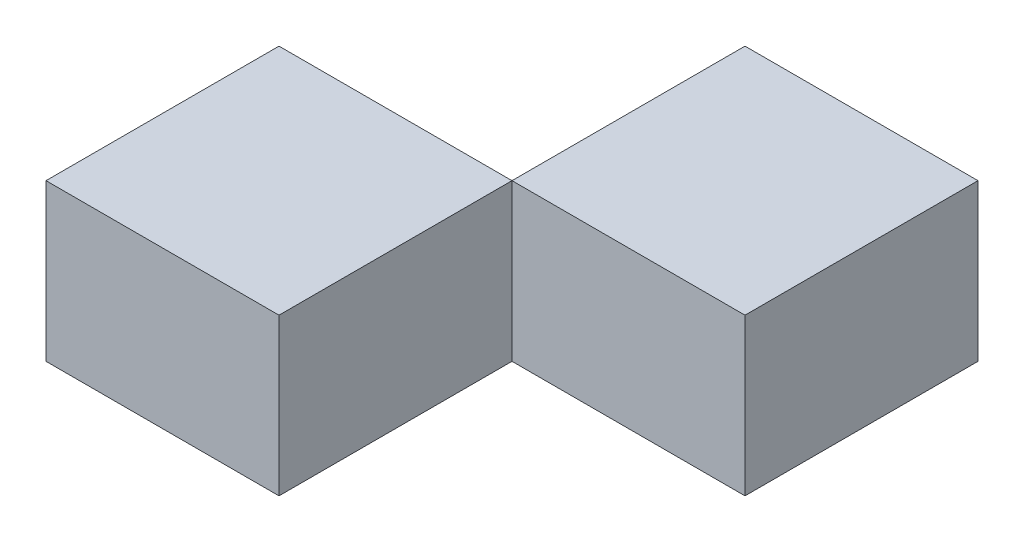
from build123d import *

# Parameters (mm, degrees)
SKETCH1_W        = 20.800105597
SKETCH1_H        = 20.800105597
EXTRUDE1_DEPTH   = 13.97
EXTRUDE1_2_DEPTH = 13.97


with BuildPart() as part:
    # Sketch1 → Extrude1 (new body)
    with BuildSketch(Plane(origin=(0, 0, 0), x_dir=(1, 0, 0), z_dir=(0, 1, 0))):
        with Locations((-10.400052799, -10.400052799)):
            Rectangle(SKETCH1_W, SKETCH1_H)
    extrude(amount=EXTRUDE1_DEPTH)


with BuildPart() as body_2:
    # Sketch1 → Extrude1 2 (new body)
    with BuildSketch(Plane(origin=(0, 0, 0), x_dir=(1, 0, 0), z_dir=(0, 1, 0))):
        with Locations((10.400052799, 10.400052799)):
            Rectangle(SKETCH1_W, SKETCH1_H)
    extrude(amount=EXTRUDE1_2_DEPTH)


solid = Compound([part.part, body_2.part])
